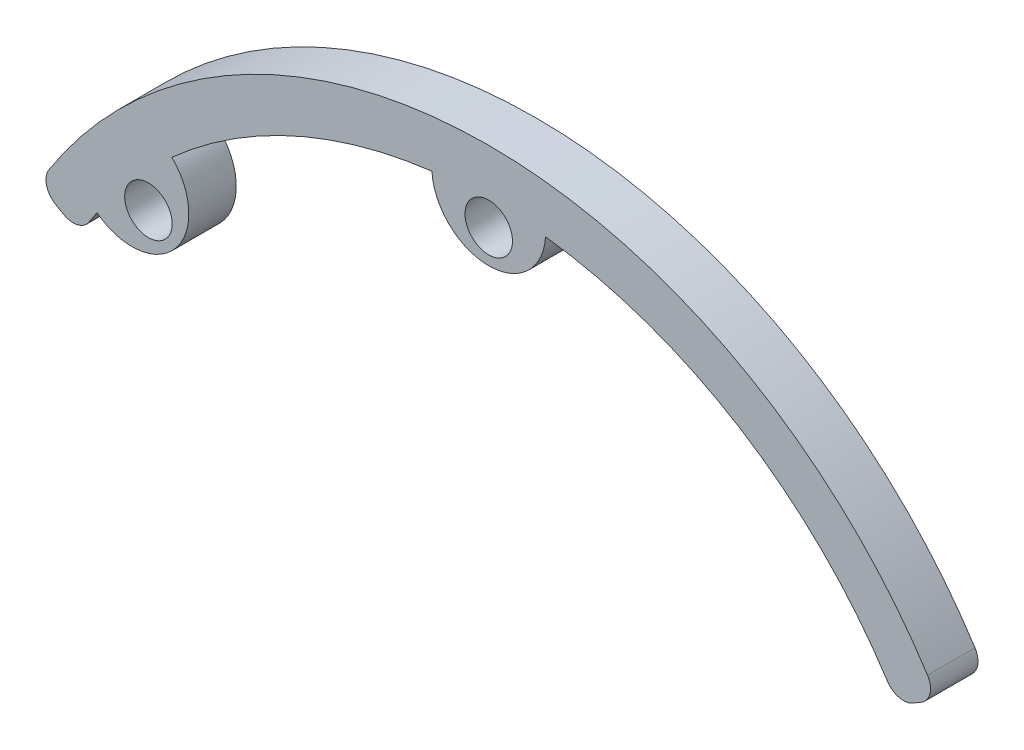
from build123d import *

# Parameters (mm, degrees)
SKETCH_1_R      = 2.5
EXTRUDE_1_DEPTH = 5
FILLET_6_R      = 2
FILLET_5_R      = 2
FILLET_7_R      = 2


with BuildPart() as part:
    # Sketch 1 → Extrude 1 (new body)
    with BuildSketch(Plane.XY):
        with BuildLine():
            ThreePointArc((47.342542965, 27.994349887), (-0.092591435, 54.999922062), (-47.436530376, 27.834790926))
            Line((-47.436530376, 27.834790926), (-43.124118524, 25.304355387))
            ThreePointArc((-43.124118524, 25.304355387), (-42.230709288, 26.768772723), (-41.287591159, 28.20168109))
            ThreePointArc((-41.287591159, 28.20168109), (-33.098749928, 28.990908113), (-33.395224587, 37.212349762))
            ThreePointArc((-33.395224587, 37.212349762), (-20.649325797, 45.536856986), (-5.989190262, 49.64))
            ThreePointArc((-5.989190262, 49.64), (0, 44), (5.989190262, 49.64))
            ThreePointArc((5.989190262, 49.64), (27.335491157, 41.866107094), (43.038675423, 25.449408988))
            Line((43.038675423, 25.449408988), (47.342542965, 27.994349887))
        make_face()
        with Locations((-35.868990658, 31.139452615)):
            Circle(SKETCH_1_R, mode=Mode.SUBTRACT)
        with Locations((0, 47.5)):
            Circle(SKETCH_1_R, mode=Mode.SUBTRACT)
    extrude(amount=EXTRUDE_1_DEPTH)

    # Fillet 6
    fillet_6_edges = [part.edges().sort_by_distance(p)[0] for p in [
        (-43.124118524, 25.304355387, 2.5),
    ]]
    fillet(fillet_6_edges, radius=FILLET_6_R)

    # Fillet 5
    fillet_5_edges = [part.edges().sort_by_distance(p)[0] for p in [
        (43.038675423, 25.449408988, 2.5),
    ]]
    fillet(fillet_5_edges, radius=FILLET_5_R)

    # Fillet 7
    fillet_7_edges = [part.edges().sort_by_distance(p)[0] for p in [
        (-47.436530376, 27.834790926, 2.5),
        (47.342542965, 27.994349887, 2.5),
    ]]
    fillet(fillet_7_edges, radius=FILLET_7_R)


solid = part.part
